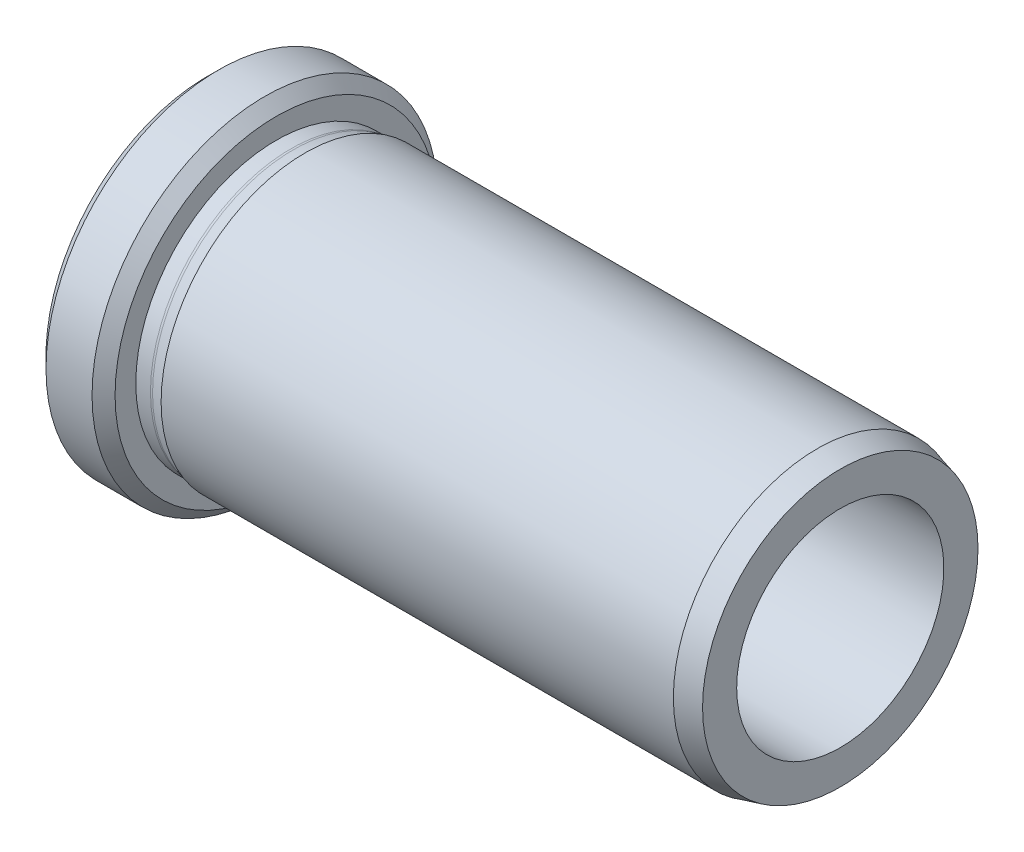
ISO-10303-21;
HEADER;
FILE_DESCRIPTION(('STEP AP214'),'2;1');
FILE_NAME('part.step','',(''),(''),'','','');
FILE_SCHEMA(('AUTOMOTIVE_DESIGN { 1 0 10303 214 1 1 1 1 }'));
ENDSEC;
DATA;
#1=APPLICATION_CONTEXT('core data for automotive mechanical design processes');
#2=APPLICATION_PROTOCOL_DEFINITION('international standard','automotive_design',2000,#1);
#3=PRODUCT_CONTEXT('',#1,'mechanical');
#4=PRODUCT('Part','Part','',(#3));
#5=PRODUCT_RELATED_PRODUCT_CATEGORY('part','',(#4));
#6=PRODUCT_DEFINITION_FORMATION('','',#4);
#7=PRODUCT_DEFINITION_CONTEXT('part definition',#1,'design');
#8=PRODUCT_DEFINITION('design','',#6,#7);
#9=PRODUCT_DEFINITION_SHAPE('','',#8);
#10=(LENGTH_UNIT() NAMED_UNIT(*) SI_UNIT(.MILLI.,.METRE.));
#11=(NAMED_UNIT(*) PLANE_ANGLE_UNIT() SI_UNIT($,.RADIAN.));
#12=(NAMED_UNIT(*) SI_UNIT($,.STERADIAN.) SOLID_ANGLE_UNIT());
#13=UNCERTAINTY_MEASURE_WITH_UNIT(LENGTH_MEASURE(1.E-05),#10,'distance_accuracy_value','');
#14=(GEOMETRIC_REPRESENTATION_CONTEXT(3) GLOBAL_UNCERTAINTY_ASSIGNED_CONTEXT((#13)) GLOBAL_UNIT_ASSIGNED_CONTEXT((#10,
#11,#12)) REPRESENTATION_CONTEXT('',''));
#15=CARTESIAN_POINT('',(0.,0.,0.));
#16=DIRECTION('',(0.,0.,1.));
#17=DIRECTION('',(1.,0.,0.));
#18=AXIS2_PLACEMENT_3D('',#15,#16,#17);
#19=CARTESIAN_POINT('',(18.075539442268,0.,0.));
#20=DIRECTION('',(-1.,0.,0.));
#21=DIRECTION('',(0.,0.,1.));
#22=AXIS2_PLACEMENT_3D('',#19,#20,#21);
#23=TOROIDAL_SURFACE('',#22,13.,0.8);
#24=CARTESIAN_POINT('',(18.075539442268,0.,0.));
#25=DIRECTION('',(-1.,0.,0.));
#26=DIRECTION('',(0.,0.,1.));
#27=AXIS2_PLACEMENT_3D('',#24,#25,#26);
#28=CIRCLE('',#27,12.2);
#29=CARTESIAN_POINT('',(18.075539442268,0.,12.2));
#30=VERTEX_POINT('',#29);
#31=EDGE_CURVE('E58',#30,#30,#28,.T.);
#32=ORIENTED_EDGE('',*,*,#31,.F.);
#33=EDGE_LOOP('',(#32));
#34=FACE_BOUND('',#33,.T.);
#35=CARTESIAN_POINT('',(18.28259467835,0.,0.));
#36=DIRECTION('',(-1.,0.,0.));
#37=DIRECTION('',(0.,0.,1.));
#38=AXIS2_PLACEMENT_3D('',#35,#36,#37);
#39=CIRCLE('',#38,12.2272593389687);
#40=CARTESIAN_POINT('',(18.28259467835,0.,12.2272593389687));
#41=VERTEX_POINT('',#40);
#42=EDGE_CURVE('E40',#41,#41,#39,.T.);
#43=ORIENTED_EDGE('',*,*,#42,.T.);
#44=EDGE_LOOP('',(#43));
#45=FACE_BOUND('',#44,.T.);
#46=ADVANCED_FACE('F14',(#34,#45),#23,.F.);
#47=CARTESIAN_POINT('',(19.3004766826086,0.,0.));
#48=DIRECTION('',(1.,0.,0.));
#49=DIRECTION('',(0.,0.,-1.));
#50=AXIS2_PLACEMENT_3D('',#47,#48,#49);
#51=CONICAL_SURFACE('',#50,12.5,0.261799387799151);
#52=ORIENTED_EDGE('',*,*,#42,.F.);
#53=EDGE_LOOP('',(#52));
#54=FACE_BOUND('',#53,.T.);
#55=CARTESIAN_POINT('',(19.3004766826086,0.,0.));
#56=DIRECTION('',(-1.,0.,0.));
#57=DIRECTION('',(0.,0.,1.));
#58=AXIS2_PLACEMENT_3D('',#55,#56,#57);
#59=CIRCLE('',#58,12.5);
#60=CARTESIAN_POINT('',(19.3004766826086,0.,12.5));
#61=VERTEX_POINT('',#60);
#62=EDGE_CURVE('E43',#61,#61,#59,.T.);
#63=ORIENTED_EDGE('',*,*,#62,.T.);
#64=EDGE_LOOP('',(#63));
#65=FACE_BOUND('',#64,.T.);
#66=ADVANCED_FACE('F66',(#54,#65),#51,.T.);
#67=CARTESIAN_POINT('',(0.,0.,0.));
#68=DIRECTION('',(-1.,0.,0.));
#69=DIRECTION('',(0.,0.,1.));
#70=AXIS2_PLACEMENT_3D('',#67,#68,#69);
#71=CYLINDRICAL_SURFACE('',#70,12.5);
#72=ORIENTED_EDGE('',*,*,#62,.F.);
#73=EDGE_LOOP('',(#72));
#74=FACE_BOUND('',#73,.T.);
#75=CARTESIAN_POINT('',(63.8004766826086,0.,0.));
#76=DIRECTION('',(-1.,0.,0.));
#77=DIRECTION('',(0.,0.,1.));
#78=AXIS2_PLACEMENT_3D('',#75,#76,#77);
#79=CIRCLE('',#78,12.5);
#80=CARTESIAN_POINT('',(63.8004766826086,0.,12.5));
#81=VERTEX_POINT('',#80);
#82=EDGE_CURVE('E46',#81,#81,#79,.T.);
#83=ORIENTED_EDGE('',*,*,#82,.T.);
#84=EDGE_LOOP('',(#83));
#85=FACE_BOUND('',#84,.T.);
#86=ADVANCED_FACE('F72',(#74,#85),#71,.T.);
#87=CARTESIAN_POINT('',(65.8004766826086,0.,0.));
#88=DIRECTION('',(-1.,0.,0.));
#89=DIRECTION('',(0.,0.,1.));
#90=AXIS2_PLACEMENT_3D('',#87,#88,#89);
#91=CONICAL_SURFACE('',#90,11.9641016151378,0.26179938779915);
#92=ORIENTED_EDGE('',*,*,#82,.F.);
#93=EDGE_LOOP('',(#92));
#94=FACE_BOUND('',#93,.T.);
#95=CARTESIAN_POINT('',(65.8004766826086,0.,0.));
#96=DIRECTION('',(-1.,0.,0.));
#97=DIRECTION('',(0.,0.,1.));
#98=AXIS2_PLACEMENT_3D('',#95,#96,#97);
#99=CIRCLE('',#98,11.9641016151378);
#100=CARTESIAN_POINT('',(65.8004766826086,0.,11.9641016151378));
#101=VERTEX_POINT('',#100);
#102=EDGE_CURVE('E49',#101,#101,#99,.T.);
#103=ORIENTED_EDGE('',*,*,#102,.T.);
#104=EDGE_LOOP('',(#103));
#105=FACE_BOUND('',#104,.T.);
#106=ADVANCED_FACE('F78',(#94,#105),#91,.T.);
#107=CARTESIAN_POINT('',(65.8004766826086,11.9641016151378,0.));
#108=DIRECTION('',(-1.,0.,0.));
#109=DIRECTION('',(0.,0.,1.));
#110=AXIS2_PLACEMENT_3D('',#107,#108,#109);
#111=PLANE('',#110);
#112=ORIENTED_EDGE('',*,*,#102,.F.);
#113=EDGE_LOOP('',(#112));
#114=FACE_BOUND('',#113,.T.);
#115=CARTESIAN_POINT('',(65.8004766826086,0.,0.));
#116=DIRECTION('',(-1.,0.,0.));
#117=DIRECTION('',(0.,0.,1.));
#118=AXIS2_PLACEMENT_3D('',#115,#116,#117);
#119=CIRCLE('',#118,9.);
#120=CARTESIAN_POINT('',(65.8004766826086,0.,9.));
#121=VERTEX_POINT('',#120);
#122=EDGE_CURVE('E52',#121,#121,#119,.T.);
#123=ORIENTED_EDGE('',*,*,#122,.T.);
#124=EDGE_LOOP('',(#123));
#125=FACE_BOUND('',#124,.T.);
#126=ADVANCED_FACE('F84',(#114,#125),#111,.F.);
#127=CARTESIAN_POINT('',(0.,0.,0.));
#128=DIRECTION('',(-1.,0.,0.));
#129=DIRECTION('',(0.,0.,1.));
#130=AXIS2_PLACEMENT_3D('',#127,#128,#129);
#131=CYLINDRICAL_SURFACE('',#130,9.);
#132=CARTESIAN_POINT('',(12.3004766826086,0.,0.));
#133=DIRECTION('',(1.,0.,0.));
#134=DIRECTION('',(0.,0.,-1.));
#135=AXIS2_PLACEMENT_3D('',#132,#133,#134);
#136=CIRCLE('',#135,9.);
#137=CARTESIAN_POINT('',(12.3004766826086,0.,-9.));
#138=VERTEX_POINT('',#137);
#139=EDGE_CURVE('E29',#138,#138,#136,.F.);
#140=ORIENTED_EDGE('',*,*,#139,.T.);
#141=EDGE_LOOP('',(#140));
#142=FACE_BOUND('',#141,.T.);
#143=ORIENTED_EDGE('',*,*,#122,.F.);
#144=EDGE_LOOP('',(#143));
#145=FACE_BOUND('',#144,.T.);
#146=ADVANCED_FACE('F90',(#142,#145),#131,.F.);
#147=CARTESIAN_POINT('',(10.8004766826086,15.,0.));
#148=DIRECTION('',(1.,0.,0.));
#149=DIRECTION('',(0.,0.,-1.));
#150=AXIS2_PLACEMENT_3D('',#147,#148,#149);
#151=PLANE('',#150);
#152=CARTESIAN_POINT('',(10.8004766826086,0.,0.));
#153=DIRECTION('',(1.,0.,0.));
#154=DIRECTION('',(0.,0.,-1.));
#155=AXIS2_PLACEMENT_3D('',#152,#153,#154);
#156=CIRCLE('',#155,10.5);
#157=CARTESIAN_POINT('',(10.8004766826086,0.,-10.5));
#158=VERTEX_POINT('',#157);
#159=EDGE_CURVE('E25',#158,#158,#156,.T.);
#160=ORIENTED_EDGE('',*,*,#159,.T.);
#161=EDGE_LOOP('',(#160));
#162=FACE_BOUND('',#161,.T.);
#163=CARTESIAN_POINT('',(10.8004766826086,0.,0.));
#164=DIRECTION('',(1.,0.,0.));
#165=DIRECTION('',(0.,0.,-1.));
#166=AXIS2_PLACEMENT_3D('',#163,#164,#165);
#167=CIRCLE('',#166,14.);
#168=CARTESIAN_POINT('',(10.8004766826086,0.,-14.));
#169=VERTEX_POINT('',#168);
#170=EDGE_CURVE('E37',#169,#169,#167,.F.);
#171=ORIENTED_EDGE('',*,*,#170,.T.);
#172=EDGE_LOOP('',(#171));
#173=FACE_BOUND('',#172,.T.);
#174=ADVANCED_FACE('F95',(#162,#173),#151,.F.);
#175=CARTESIAN_POINT('',(0.,0.,0.));
#176=DIRECTION('',(-1.,0.,0.));
#177=DIRECTION('',(0.,0.,1.));
#178=AXIS2_PLACEMENT_3D('',#175,#176,#177);
#179=CYLINDRICAL_SURFACE('',#178,15.);
#180=CARTESIAN_POINT('',(15.8004766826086,0.,0.));
#181=DIRECTION('',(-1.,0.,0.));
#182=DIRECTION('',(0.,0.,1.));
#183=AXIS2_PLACEMENT_3D('',#180,#181,#182);
#184=CIRCLE('',#183,15.);
#185=CARTESIAN_POINT('',(15.8004766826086,0.,15.));
#186=VERTEX_POINT('',#185);
#187=EDGE_CURVE('E21',#186,#186,#184,.T.);
#188=ORIENTED_EDGE('',*,*,#187,.T.);
#189=EDGE_LOOP('',(#188));
#190=FACE_BOUND('',#189,.T.);
#191=CARTESIAN_POINT('',(11.8004766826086,0.,0.));
#192=DIRECTION('',(1.,0.,0.));
#193=DIRECTION('',(0.,0.,-1.));
#194=AXIS2_PLACEMENT_3D('',#191,#192,#193);
#195=CIRCLE('',#194,15.);
#196=CARTESIAN_POINT('',(11.8004766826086,0.,-15.));
#197=VERTEX_POINT('',#196);
#198=EDGE_CURVE('E34',#197,#197,#195,.T.);
#199=ORIENTED_EDGE('',*,*,#198,.T.);
#200=EDGE_LOOP('',(#199));
#201=FACE_BOUND('',#200,.T.);
#202=ADVANCED_FACE('F103',(#190,#201),#179,.T.);
#203=CARTESIAN_POINT('',(16.8004766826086,15.,0.));
#204=DIRECTION('',(-1.,0.,0.));
#205=DIRECTION('',(0.,0.,1.));
#206=AXIS2_PLACEMENT_3D('',#203,#204,#205);
#207=PLANE('',#206);
#208=CARTESIAN_POINT('',(16.8004766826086,0.,0.));
#209=DIRECTION('',(-1.,0.,0.));
#210=DIRECTION('',(0.,0.,1.));
#211=AXIS2_PLACEMENT_3D('',#208,#209,#210);
#212=CIRCLE('',#211,14.);
#213=CARTESIAN_POINT('',(16.8004766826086,0.,14.));
#214=VERTEX_POINT('',#213);
#215=EDGE_CURVE('E9',#214,#214,#212,.F.);
#216=ORIENTED_EDGE('',*,*,#215,.T.);
#217=EDGE_LOOP('',(#216));
#218=FACE_BOUND('',#217,.T.);
#219=CARTESIAN_POINT('',(16.8004766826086,0.,0.));
#220=DIRECTION('',(-1.,0.,0.));
#221=DIRECTION('',(0.,0.,1.));
#222=AXIS2_PLACEMENT_3D('',#219,#220,#221);
#223=CIRCLE('',#222,12.2);
#224=CARTESIAN_POINT('',(16.8004766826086,0.,12.2));
#225=VERTEX_POINT('',#224);
#226=EDGE_CURVE('E55',#225,#225,#223,.T.);
#227=ORIENTED_EDGE('',*,*,#226,.T.);
#228=EDGE_LOOP('',(#227));
#229=FACE_BOUND('',#228,.T.);
#230=ADVANCED_FACE('F142',(#218,#229),#207,.F.);
#231=CARTESIAN_POINT('',(0.,0.,0.));
#232=DIRECTION('',(-1.,0.,0.));
#233=DIRECTION('',(0.,0.,1.));
#234=AXIS2_PLACEMENT_3D('',#231,#232,#233);
#235=CYLINDRICAL_SURFACE('',#234,12.2);
#236=ORIENTED_EDGE('',*,*,#226,.F.);
#237=EDGE_LOOP('',(#236));
#238=FACE_BOUND('',#237,.T.);
#239=ORIENTED_EDGE('',*,*,#31,.T.);
#240=EDGE_LOOP('',(#239));
#241=FACE_BOUND('',#240,.T.);
#242=ADVANCED_FACE('F62',(#238,#241),#235,.T.);
#243=CARTESIAN_POINT('',(10.8004766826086,0.,0.));
#244=DIRECTION('',(1.,0.,0.));
#245=DIRECTION('',(0.,0.,-1.));
#246=AXIS2_PLACEMENT_3D('',#243,#244,#245);
#247=CONICAL_SURFACE('',#246,14.,0.785398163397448);
#248=ORIENTED_EDGE('',*,*,#198,.F.);
#249=EDGE_LOOP('',(#248));
#250=FACE_BOUND('',#249,.T.);
#251=ORIENTED_EDGE('',*,*,#170,.F.);
#252=EDGE_LOOP('',(#251));
#253=FACE_BOUND('',#252,.T.);
#254=ADVANCED_FACE('F108',(#250,#253),#247,.T.);
#255=CARTESIAN_POINT('',(12.3004766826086,0.,0.));
#256=DIRECTION('',(1.,0.,0.));
#257=DIRECTION('',(0.,0.,-1.));
#258=AXIS2_PLACEMENT_3D('',#255,#256,#257);
#259=TOROIDAL_SURFACE('',#258,10.5,1.5);
#260=ORIENTED_EDGE('',*,*,#159,.F.);
#261=EDGE_LOOP('',(#260));
#262=FACE_BOUND('',#261,.T.);
#263=ORIENTED_EDGE('',*,*,#139,.F.);
#264=EDGE_LOOP('',(#263));
#265=FACE_BOUND('',#264,.T.);
#266=ADVANCED_FACE('F110',(#262,#265),#259,.T.);
#267=CARTESIAN_POINT('',(15.8004766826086,0.,0.));
#268=DIRECTION('',(-1.,0.,0.));
#269=DIRECTION('',(0.,0.,1.));
#270=AXIS2_PLACEMENT_3D('',#267,#268,#269);
#271=CONICAL_SURFACE('',#270,15.,0.78539816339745);
#272=ORIENTED_EDGE('',*,*,#215,.F.);
#273=EDGE_LOOP('',(#272));
#274=FACE_BOUND('',#273,.T.);
#275=ORIENTED_EDGE('',*,*,#187,.F.);
#276=EDGE_LOOP('',(#275));
#277=FACE_BOUND('',#276,.T.);
#278=ADVANCED_FACE('F16',(#274,#277),#271,.T.);
#279=CLOSED_SHELL('',(#46,#66,#86,#106,#126,#146,#174,#202,#230,#242,#254,#266,#278));
#280=MANIFOLD_SOLID_BREP('B1',#279);
#281=ADVANCED_BREP_SHAPE_REPRESENTATION('',(#18,#280),#14);
#282=SHAPE_DEFINITION_REPRESENTATION(#9,#281);
ENDSEC;
END-ISO-10303-21;
